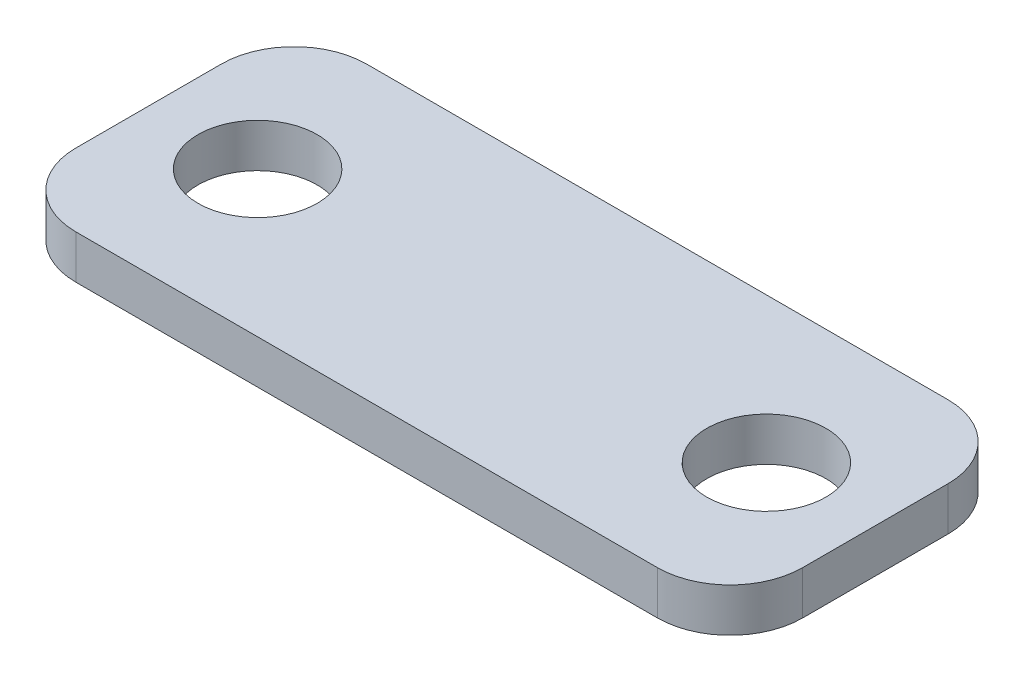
from build123d import *

# Parameters (mm, degrees)
SKETCH1_W           = 50
SKETCH1_H           = 20
BOSS_EXTRUDE1_DEPTH = 3
SKETCH2_R           = 4.1
CUT_EXTRUDE1_DEPTH  = 3
FILLET1_R           = 5


with BuildPart() as part:
    # Sketch1 → Boss-Extrude1 (new body)
    with BuildSketch(Plane(origin=(0, 0, 0), x_dir=(1, 0, 0), z_dir=(0, 1, 0))):
        Rectangle(SKETCH1_W, SKETCH1_H)
    extrude(amount=BOSS_EXTRUDE1_DEPTH)

    # Sketch2 → Cut-Extrude1 (cut)
    with BuildSketch(Plane(origin=(0, 3, 0), x_dir=(1, 0, 0), z_dir=(0, 1, 0))):
        with Locations(Location((-17.5, 0, 0), (0, 0, 270))):
            Circle(SKETCH2_R)
        with Locations(Location((17.5, 0, 0), (0, 0, 270))):
            Circle(SKETCH2_R)
    extrude(amount=-CUT_EXTRUDE1_DEPTH, mode=Mode.SUBTRACT)

    # Fillet1
    fillet1_edges = [part.edges().sort_by_distance(p)[0] for p in [
        (25, 1.5, 10),
        (-25, 1.5, 10),
        (-25, 1.5, -10),
        (25, 1.5, -10),
    ]]
    fillet(fillet1_edges, radius=FILLET1_R)


solid = part.part
